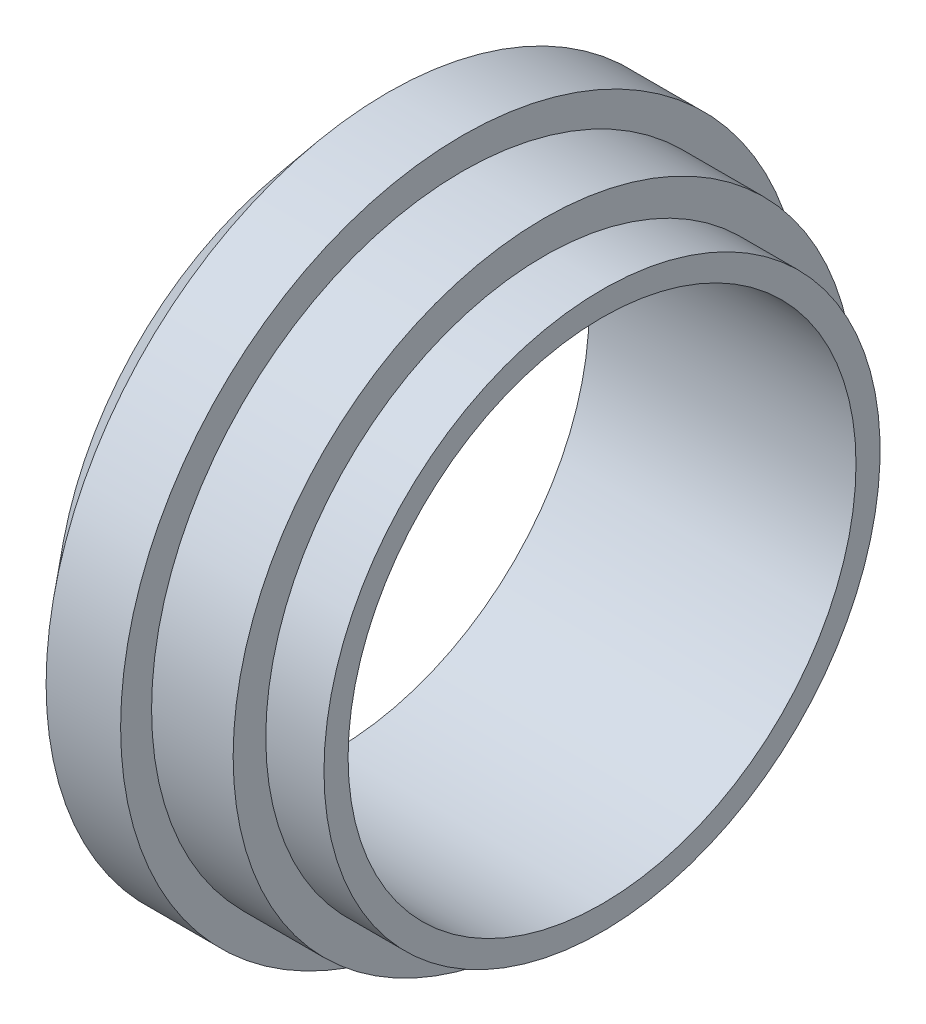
ISO-10303-21;
HEADER;
FILE_DESCRIPTION(('STEP AP214'),'2;1');
FILE_NAME('part.step','',(''),(''),'','','');
FILE_SCHEMA(('AUTOMOTIVE_DESIGN { 1 0 10303 214 1 1 1 1 }'));
ENDSEC;
DATA;
#1=APPLICATION_CONTEXT('core data for automotive mechanical design processes');
#2=APPLICATION_PROTOCOL_DEFINITION('international standard','automotive_design',2000,#1);
#3=PRODUCT_CONTEXT('',#1,'mechanical');
#4=PRODUCT('Part','Part','',(#3));
#5=PRODUCT_RELATED_PRODUCT_CATEGORY('part','',(#4));
#6=PRODUCT_DEFINITION_FORMATION('','',#4);
#7=PRODUCT_DEFINITION_CONTEXT('part definition',#1,'design');
#8=PRODUCT_DEFINITION('design','',#6,#7);
#9=PRODUCT_DEFINITION_SHAPE('','',#8);
#10=(LENGTH_UNIT() NAMED_UNIT(*) SI_UNIT(.MILLI.,.METRE.));
#11=(NAMED_UNIT(*) PLANE_ANGLE_UNIT() SI_UNIT($,.RADIAN.));
#12=(NAMED_UNIT(*) SI_UNIT($,.STERADIAN.) SOLID_ANGLE_UNIT());
#13=UNCERTAINTY_MEASURE_WITH_UNIT(LENGTH_MEASURE(1.E-05),#10,'distance_accuracy_value','');
#14=(GEOMETRIC_REPRESENTATION_CONTEXT(3) GLOBAL_UNCERTAINTY_ASSIGNED_CONTEXT((#13)) GLOBAL_UNIT_ASSIGNED_CONTEXT((#10,
#11,#12)) REPRESENTATION_CONTEXT('',''));
#15=CARTESIAN_POINT('',(0.,0.,0.));
#16=DIRECTION('',(0.,0.,1.));
#17=DIRECTION('',(1.,0.,0.));
#18=AXIS2_PLACEMENT_3D('',#15,#16,#17);
#19=CARTESIAN_POINT('',(0.,19.05,0.));
#20=DIRECTION('',(1.,0.,0.));
#21=DIRECTION('',(0.,0.,-1.));
#22=AXIS2_PLACEMENT_3D('',#19,#20,#21);
#23=PLANE('',#22);
#24=CARTESIAN_POINT('',(0.,19.05,0.));
#25=DIRECTION('',(-1.,0.,0.));
#26=DIRECTION('',(0.,0.,1.));
#27=AXIS2_PLACEMENT_3D('',#24,#25,#26);
#28=CIRCLE('',#27,17.399);
#29=CARTESIAN_POINT('',(0.,19.05,17.399));
#30=VERTEX_POINT('',#29);
#31=EDGE_CURVE('E59',#30,#30,#28,.T.);
#32=ORIENTED_EDGE('',*,*,#31,.T.);
#33=EDGE_LOOP('',(#32));
#34=FACE_BOUND('',#33,.T.);
#35=CARTESIAN_POINT('',(0.,19.05,0.));
#36=DIRECTION('',(-1.,0.,0.));
#37=DIRECTION('',(0.,0.,1.));
#38=AXIS2_PLACEMENT_3D('',#35,#36,#37);
#39=CIRCLE('',#38,19.05);
#40=CARTESIAN_POINT('',(0.,19.05,19.05));
#41=VERTEX_POINT('',#40);
#42=EDGE_CURVE('E10',#41,#41,#39,.T.);
#43=ORIENTED_EDGE('',*,*,#42,.F.);
#44=EDGE_LOOP('',(#43));
#45=FACE_BOUND('',#44,.T.);
#46=ADVANCED_FACE('F31',(#34,#45),#23,.T.);
#47=CARTESIAN_POINT('',(-18.288,19.05,0.));
#48=DIRECTION('',(-1.,0.,0.));
#49=DIRECTION('',(0.,0.,1.));
#50=AXIS2_PLACEMENT_3D('',#47,#48,#49);
#51=CYLINDRICAL_SURFACE('',#50,19.05);
#52=ORIENTED_EDGE('',*,*,#42,.T.);
#53=EDGE_LOOP('',(#52));
#54=FACE_BOUND('',#53,.T.);
#55=CARTESIAN_POINT('',(-3.9878,19.05,0.));
#56=DIRECTION('',(-1.,0.,0.));
#57=DIRECTION('',(0.,0.,1.));
#58=AXIS2_PLACEMENT_3D('',#55,#56,#57);
#59=CIRCLE('',#58,19.05);
#60=CARTESIAN_POINT('',(-3.9878,19.05,19.05));
#61=VERTEX_POINT('',#60);
#62=EDGE_CURVE('E37',#61,#61,#59,.T.);
#63=ORIENTED_EDGE('',*,*,#62,.F.);
#64=EDGE_LOOP('',(#63));
#65=FACE_BOUND('',#64,.T.);
#66=ADVANCED_FACE('F92',(#54,#65),#51,.T.);
#67=CARTESIAN_POINT('',(-3.9878,0.,0.));
#68=DIRECTION('',(1.,0.,0.));
#69=DIRECTION('',(0.,0.,-1.));
#70=AXIS2_PLACEMENT_3D('',#67,#68,#69);
#71=PLANE('',#70);
#72=ORIENTED_EDGE('',*,*,#62,.T.);
#73=EDGE_LOOP('',(#72));
#74=FACE_BOUND('',#73,.T.);
#75=CARTESIAN_POINT('',(-3.9878,19.05,0.));
#76=DIRECTION('',(-1.,0.,0.));
#77=DIRECTION('',(0.,0.,1.));
#78=AXIS2_PLACEMENT_3D('',#75,#76,#77);
#79=CIRCLE('',#78,21.2852);
#80=CARTESIAN_POINT('',(-3.9878,19.05,21.2852));
#81=VERTEX_POINT('',#80);
#82=EDGE_CURVE('E41',#81,#81,#79,.T.);
#83=ORIENTED_EDGE('',*,*,#82,.F.);
#84=EDGE_LOOP('',(#83));
#85=FACE_BOUND('',#84,.T.);
#86=ADVANCED_FACE('F96',(#74,#85),#71,.T.);
#87=CARTESIAN_POINT('',(-18.288,19.05,0.));
#88=DIRECTION('',(-1.,0.,0.));
#89=DIRECTION('',(0.,0.,1.));
#90=AXIS2_PLACEMENT_3D('',#87,#88,#89);
#91=CYLINDRICAL_SURFACE('',#90,21.2852);
#92=ORIENTED_EDGE('',*,*,#82,.T.);
#93=EDGE_LOOP('',(#92));
#94=FACE_BOUND('',#93,.T.);
#95=CARTESIAN_POINT('',(-9.5758,19.05,0.));
#96=DIRECTION('',(-1.,0.,0.));
#97=DIRECTION('',(0.,0.,1.));
#98=AXIS2_PLACEMENT_3D('',#95,#96,#97);
#99=CIRCLE('',#98,21.2852);
#100=CARTESIAN_POINT('',(-9.5758,19.05,21.2852));
#101=VERTEX_POINT('',#100);
#102=EDGE_CURVE('E45',#101,#101,#99,.T.);
#103=ORIENTED_EDGE('',*,*,#102,.F.);
#104=EDGE_LOOP('',(#103));
#105=FACE_BOUND('',#104,.T.);
#106=ADVANCED_FACE('F100',(#94,#105),#91,.T.);
#107=CARTESIAN_POINT('',(-9.5758,-2.2352,0.));
#108=DIRECTION('',(1.,0.,0.));
#109=DIRECTION('',(0.,0.,-1.));
#110=AXIS2_PLACEMENT_3D('',#107,#108,#109);
#111=PLANE('',#110);
#112=ORIENTED_EDGE('',*,*,#102,.T.);
#113=EDGE_LOOP('',(#112));
#114=FACE_BOUND('',#113,.T.);
#115=CARTESIAN_POINT('',(-9.5758,19.05,0.));
#116=DIRECTION('',(-1.,0.,0.));
#117=DIRECTION('',(0.,0.,1.));
#118=AXIS2_PLACEMENT_3D('',#115,#116,#117);
#119=CIRCLE('',#118,23.4061);
#120=CARTESIAN_POINT('',(-9.5758,19.05,23.4061));
#121=VERTEX_POINT('',#120);
#122=EDGE_CURVE('E50',#121,#121,#119,.T.);
#123=ORIENTED_EDGE('',*,*,#122,.F.);
#124=EDGE_LOOP('',(#123));
#125=FACE_BOUND('',#124,.T.);
#126=ADVANCED_FACE('F88',(#114,#125),#111,.T.);
#127=CARTESIAN_POINT('',(-18.288,19.05,0.));
#128=DIRECTION('',(-1.,0.,0.));
#129=DIRECTION('',(0.,0.,1.));
#130=AXIS2_PLACEMENT_3D('',#127,#128,#129);
#131=CYLINDRICAL_SURFACE('',#130,23.4061);
#132=ORIENTED_EDGE('',*,*,#122,.T.);
#133=EDGE_LOOP('',(#132));
#134=FACE_BOUND('',#133,.T.);
#135=CARTESIAN_POINT('',(-14.6812,19.05,0.));
#136=DIRECTION('',(-1.,0.,0.));
#137=DIRECTION('',(0.,0.,1.));
#138=AXIS2_PLACEMENT_3D('',#135,#136,#137);
#139=CIRCLE('',#138,23.4061);
#140=CARTESIAN_POINT('',(-14.6812,19.05,23.4061));
#141=VERTEX_POINT('',#140);
#142=EDGE_CURVE('E53',#141,#141,#139,.T.);
#143=ORIENTED_EDGE('',*,*,#142,.F.);
#144=EDGE_LOOP('',(#143));
#145=FACE_BOUND('',#144,.T.);
#146=ADVANCED_FACE('F82',(#134,#145),#131,.T.);
#147=CARTESIAN_POINT('',(-18.288,19.05,0.));
#148=DIRECTION('',(1.,0.,0.));
#149=DIRECTION('',(0.,0.,-1.));
#150=AXIS2_PLACEMENT_3D('',#147,#148,#149);
#151=CONICAL_SURFACE('',#150,19.1008,0.873452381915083);
#152=ORIENTED_EDGE('',*,*,#142,.T.);
#153=EDGE_LOOP('',(#152));
#154=FACE_BOUND('',#153,.T.);
#155=CARTESIAN_POINT('',(-18.288,19.05,0.));
#156=DIRECTION('',(-1.,0.,0.));
#157=DIRECTION('',(0.,0.,1.));
#158=AXIS2_PLACEMENT_3D('',#155,#156,#157);
#159=CIRCLE('',#158,19.1008);
#160=CARTESIAN_POINT('',(-18.288,19.05,19.1008));
#161=VERTEX_POINT('',#160);
#162=EDGE_CURVE('E56',#161,#161,#159,.T.);
#163=ORIENTED_EDGE('',*,*,#162,.F.);
#164=EDGE_LOOP('',(#163));
#165=FACE_BOUND('',#164,.T.);
#166=ADVANCED_FACE('F77',(#154,#165),#151,.T.);
#167=CARTESIAN_POINT('',(-18.288,-0.0508000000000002,0.));
#168=DIRECTION('',(-1.,0.,0.));
#169=DIRECTION('',(0.,0.,1.));
#170=AXIS2_PLACEMENT_3D('',#167,#168,#169);
#171=PLANE('',#170);
#172=CARTESIAN_POINT('',(-18.288,19.05,0.));
#173=DIRECTION('',(-1.,0.,0.));
#174=DIRECTION('',(0.,0.,1.));
#175=AXIS2_PLACEMENT_3D('',#172,#173,#174);
#176=CIRCLE('',#175,17.399);
#177=CARTESIAN_POINT('',(-18.288,19.05,17.399));
#178=VERTEX_POINT('',#177);
#179=EDGE_CURVE('E60',#178,#178,#176,.T.);
#180=ORIENTED_EDGE('',*,*,#179,.F.);
#181=EDGE_LOOP('',(#180));
#182=FACE_BOUND('',#181,.T.);
#183=ORIENTED_EDGE('',*,*,#162,.T.);
#184=EDGE_LOOP('',(#183));
#185=FACE_BOUND('',#184,.T.);
#186=ADVANCED_FACE('F71',(#182,#185),#171,.T.);
#187=CARTESIAN_POINT('',(0.,19.05,0.));
#188=DIRECTION('',(-1.,0.,0.));
#189=DIRECTION('',(0.,0.,1.));
#190=AXIS2_PLACEMENT_3D('',#187,#188,#189);
#191=CYLINDRICAL_SURFACE('',#190,17.399);
#192=ORIENTED_EDGE('',*,*,#31,.F.);
#193=EDGE_LOOP('',(#192));
#194=FACE_BOUND('',#193,.T.);
#195=ORIENTED_EDGE('',*,*,#179,.T.);
#196=EDGE_LOOP('',(#195));
#197=FACE_BOUND('',#196,.T.);
#198=ADVANCED_FACE('F68',(#194,#197),#191,.F.);
#199=CLOSED_SHELL('',(#46,#66,#86,#106,#126,#146,#166,#186,#198));
#200=MANIFOLD_SOLID_BREP('B2',#199);
#201=ADVANCED_BREP_SHAPE_REPRESENTATION('',(#18,#200),#14);
#202=SHAPE_DEFINITION_REPRESENTATION(#9,#201);
ENDSEC;
END-ISO-10303-21;
